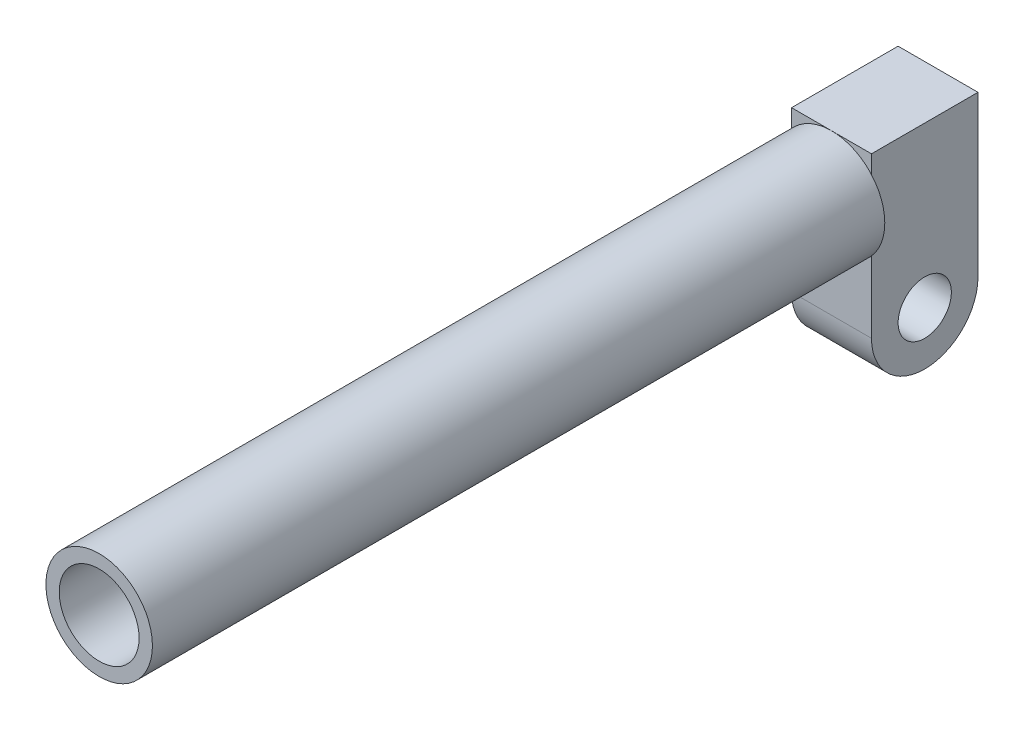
from build123d import *

# Parameters (mm, degrees)
SKETCH1_R           = 40
SKETCH1_R_2         = 20
BOSS_EXTRUDE1_DEPTH = 30
SKETCH2_R           = 40
SKETCH2_R_2         = 30
BOSS_EXTRUDE3_DEPTH = 550


with BuildPart() as part:
    # Sketch1 → Boss-Extrude1 (new, symmetric)
    # profile 1 of 2: a face of its own
    with BuildSketch(Plane(origin=(0, 0, 0), x_dir=(0, 0, -1), z_dir=(1, 0, 0))):
        with BuildLine():
            Line((-40, 120), (-40, 0))
            ThreePointArc((-40, 0), (0, 40), (40, 0))
            Line((40, 0), (40, 120))
            Line((40, 120), (-40, 120))
        make_face()
    # profile 2 of 2: a face of its own
    with BuildSketch(Plane(origin=(0, 0, 0), x_dir=(0, 0, -1), z_dir=(1, 0, 0))):
        Circle(SKETCH1_R)
        Circle(SKETCH1_R_2, mode=Mode.SUBTRACT)
    extrude(amount=BOSS_EXTRUDE1_DEPTH, both=True)


with BuildPart() as body_2:
    # Sketch2 → Boss-Extrude3 (new body)
    with BuildSketch(Plane.XY.offset(40)):
        with Locations((0, 80)):
            Circle(SKETCH2_R)
        with Locations((0, 80)):
            Circle(SKETCH2_R_2, mode=Mode.SUBTRACT)
    extrude(amount=BOSS_EXTRUDE3_DEPTH)


solid = Compound([part.part, body_2.part])
